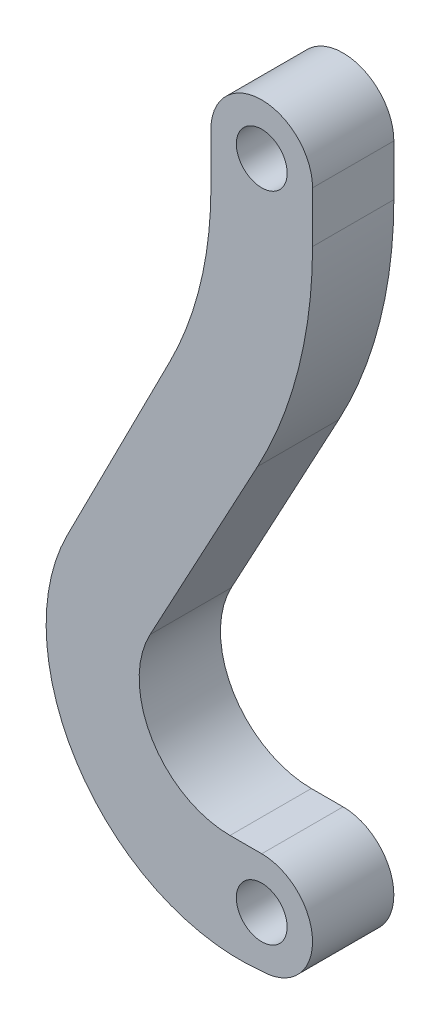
from build123d import *

# Parameters (mm, degrees)
SKETCH1_R      = 0.5
EXTRUDE1_DEPTH = 1.6


with BuildPart() as part:
    # Sketch1 → Extrude1 (new body)
    with BuildSketch(Plane.XY):
        with BuildLine():
            Line((2, 12.85), (2, 11.849199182))
            ThreePointArc((2, 11.849199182), (1.72498595, 9.63636179), (0.916676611, 7.558161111))
            Line((0.916676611, 7.558161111), (-1.19809163, 3.636817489))
            ThreePointArc((-1.19809163, 3.636817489), (-1.159680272, 1.871670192), (0.375706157, 1))
            Line((0.375706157, 1), (1, 1))
            ThreePointArc((1, 1), (2, 0), (1, -1))
            ThreePointArc((1, -1), (-2.562827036, 0.613725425), (-2.828247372, 4.515955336))
            Line((-2.828247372, 4.515955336), (-0.806454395, 8.487440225))
            ThreePointArc((-0.806454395, 8.487440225), (-0.204433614, 10.12063099), (0, 11.849199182))
            Line((0, 11.849199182), (0, 12.85))
            ThreePointArc((0, 12.85), (1, 13.85), (2, 12.85))
        make_face()
        with Locations((1, 12.85)):
            Circle(SKETCH1_R, mode=Mode.SUBTRACT)
        with Locations((1, 0)):
            Circle(SKETCH1_R, mode=Mode.SUBTRACT)
    extrude(amount=EXTRUDE1_DEPTH)


solid = part.part
